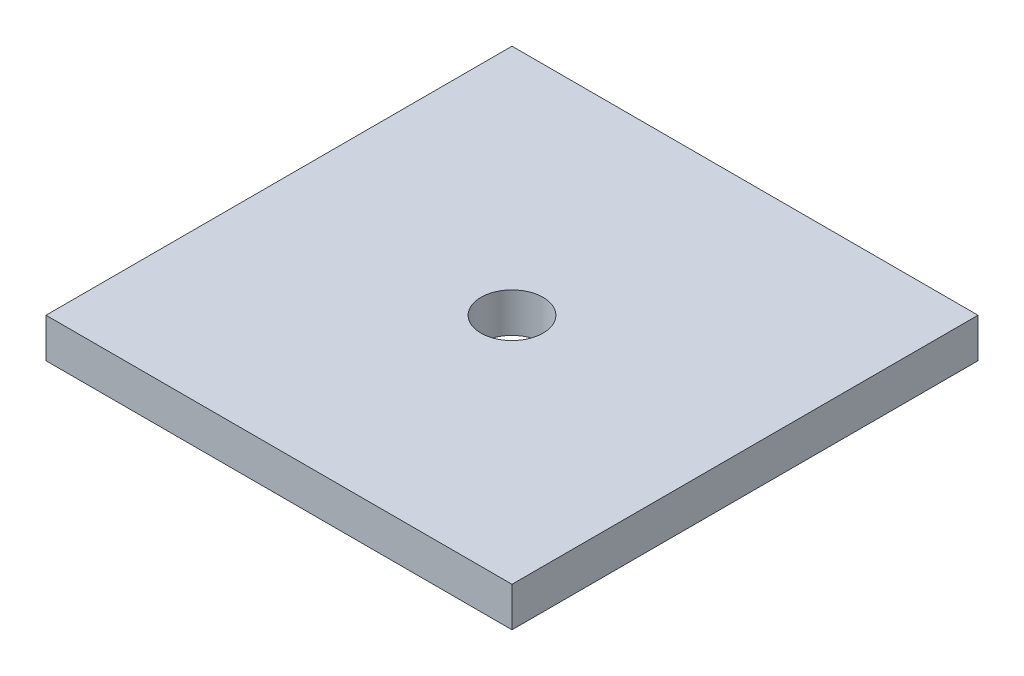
from build123d import *

# Parameters (mm, degrees)
SKETCH1_W                  = 75
SKETCH1_H                  = 75
BOSS_EXTRUDE1_DEPTH        = 6.35
F_10_0_10_DIAMETER_HOLE1_D = 10


with BuildPart() as part:
    # Sketch1 → Boss-Extrude1 (new body)
    with BuildSketch(Plane(origin=(0, 0, 0), x_dir=(1, 0, 0), z_dir=(0, 1, 0))):
        Rectangle(SKETCH1_W, SKETCH1_H)
    extrude(amount=BOSS_EXTRUDE1_DEPTH)

    # 10.0 _10_ Diameter Hole1 (through all)
    with Locations(Plane(origin=(0, 6.35, 0), x_dir=(-1, 0, 0), z_dir=(0, 1, 0))):
        with Locations((0, 0)):
            Hole(F_10_0_10_DIAMETER_HOLE1_D / 2)


solid = part.part
